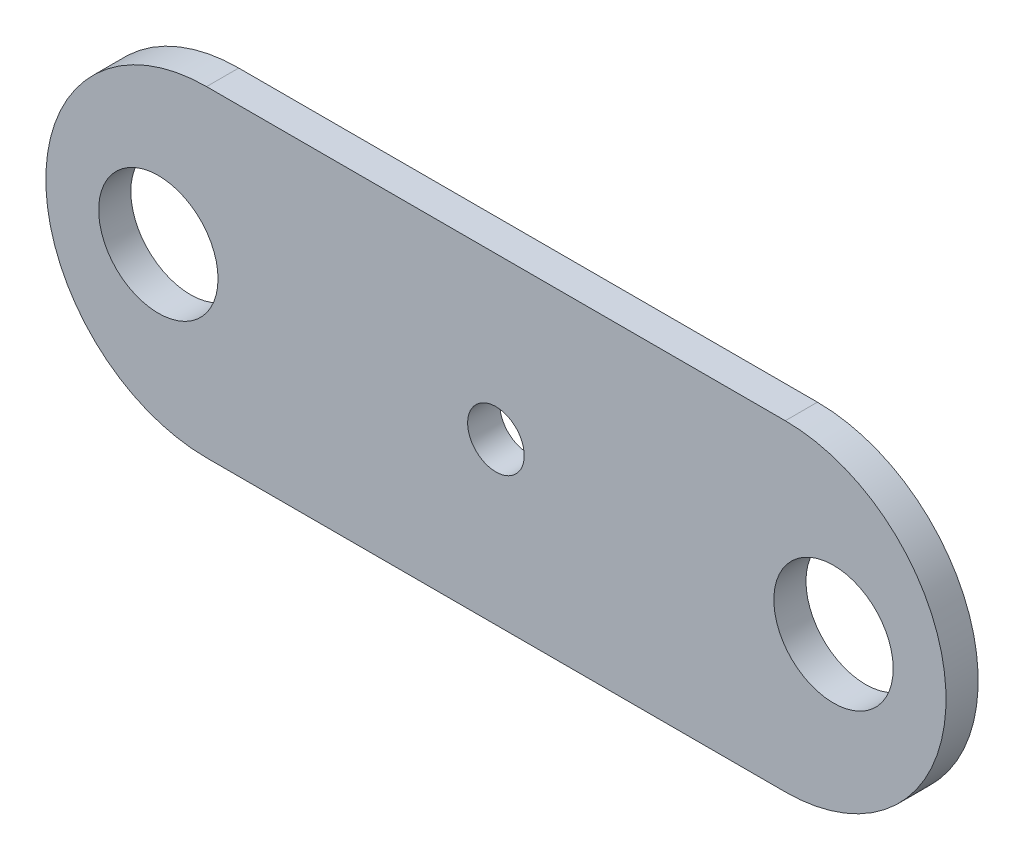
ISO-10303-21;
HEADER;
FILE_DESCRIPTION(('STEP AP214'),'2;1');
FILE_NAME('part.step','',(''),(''),'','','');
FILE_SCHEMA(('AUTOMOTIVE_DESIGN { 1 0 10303 214 1 1 1 1 }'));
ENDSEC;
DATA;
#1=APPLICATION_CONTEXT('core data for automotive mechanical design processes');
#2=APPLICATION_PROTOCOL_DEFINITION('international standard','automotive_design',2000,#1);
#3=PRODUCT_CONTEXT('',#1,'mechanical');
#4=PRODUCT('Part','Part','',(#3));
#5=PRODUCT_RELATED_PRODUCT_CATEGORY('part','',(#4));
#6=PRODUCT_DEFINITION_FORMATION('','',#4);
#7=PRODUCT_DEFINITION_CONTEXT('part definition',#1,'design');
#8=PRODUCT_DEFINITION('design','',#6,#7);
#9=PRODUCT_DEFINITION_SHAPE('','',#8);
#10=(LENGTH_UNIT() NAMED_UNIT(*) SI_UNIT(.MILLI.,.METRE.));
#11=(NAMED_UNIT(*) PLANE_ANGLE_UNIT() SI_UNIT($,.RADIAN.));
#12=(NAMED_UNIT(*) SI_UNIT($,.STERADIAN.) SOLID_ANGLE_UNIT());
#13=UNCERTAINTY_MEASURE_WITH_UNIT(LENGTH_MEASURE(1.E-05),#10,'distance_accuracy_value','');
#14=(GEOMETRIC_REPRESENTATION_CONTEXT(3) GLOBAL_UNCERTAINTY_ASSIGNED_CONTEXT((#13)) GLOBAL_UNIT_ASSIGNED_CONTEXT((#10,
#11,#12)) REPRESENTATION_CONTEXT('',''));
#15=CARTESIAN_POINT('',(0.,0.,0.));
#16=DIRECTION('',(0.,0.,1.));
#17=DIRECTION('',(1.,0.,0.));
#18=AXIS2_PLACEMENT_3D('',#15,#16,#17);
#19=CARTESIAN_POINT('',(-7.14375,0.,0.396875));
#20=DIRECTION('',(0.,0.,-1.));
#21=DIRECTION('',(-1.,0.,0.));
#22=AXIS2_PLACEMENT_3D('',#19,#20,#21);
#23=CYLINDRICAL_SURFACE('',#22,3.96875);
#24=CARTESIAN_POINT('',(-7.14375,0.,-0.396875));
#25=DIRECTION('',(0.,0.,1.));
#26=DIRECTION('',(-1.,0.,0.));
#27=AXIS2_PLACEMENT_3D('',#24,#25,#26);
#28=CIRCLE('',#27,3.96875);
#29=CARTESIAN_POINT('',(-7.14375,3.96875,-0.396875));
#30=VERTEX_POINT('',#29);
#31=CARTESIAN_POINT('',(-7.14375,-3.96875,-0.396875));
#32=VERTEX_POINT('',#31);
#33=EDGE_CURVE('E77',#30,#32,#28,.T.);
#34=ORIENTED_EDGE('',*,*,#33,.T.);
#35=DIRECTION('',(0.,0.,-1.));
#36=VECTOR('',#35,1.);
#37=CARTESIAN_POINT('',(-7.14375,-3.96875,0.396875));
#38=LINE('',#37,#36);
#39=CARTESIAN_POINT('',(-7.14375,-3.96875,0.396875));
#40=VERTEX_POINT('',#39);
#41=EDGE_CURVE('E11',#40,#32,#38,.T.);
#42=ORIENTED_EDGE('',*,*,#41,.F.);
#43=CARTESIAN_POINT('',(-7.14375,0.,0.396875));
#44=DIRECTION('',(0.,0.,1.));
#45=DIRECTION('',(-1.,0.,0.));
#46=AXIS2_PLACEMENT_3D('',#43,#44,#45);
#47=CIRCLE('',#46,3.96875);
#48=CARTESIAN_POINT('',(-7.14375,3.96875,0.396875));
#49=VERTEX_POINT('',#48);
#50=EDGE_CURVE('E100',#49,#40,#47,.T.);
#51=ORIENTED_EDGE('',*,*,#50,.F.);
#52=DIRECTION('',(0.,0.,-1.));
#53=VECTOR('',#52,1.);
#54=CARTESIAN_POINT('',(-7.14375,3.96875,0.396875));
#55=LINE('',#54,#53);
#56=EDGE_CURVE('E89',#49,#30,#55,.T.);
#57=ORIENTED_EDGE('',*,*,#56,.T.);
#58=EDGE_LOOP('',(#34,#42,#51,#57));
#59=FACE_BOUND('',#58,.T.);
#60=ADVANCED_FACE('F31',(#59),#23,.T.);
#61=CARTESIAN_POINT('',(-7.14375,-3.96875,0.396875));
#62=DIRECTION('',(0.,1.,0.));
#63=DIRECTION('',(0.,0.,1.));
#64=AXIS2_PLACEMENT_3D('',#61,#62,#63);
#65=PLANE('',#64);
#66=DIRECTION('',(1.,0.,0.));
#67=VECTOR('',#66,1.);
#68=CARTESIAN_POINT('',(-7.14375,-3.96875,-0.396875));
#69=LINE('',#68,#67);
#70=CARTESIAN_POINT('',(7.14375,-3.96875,-0.396875));
#71=VERTEX_POINT('',#70);
#72=EDGE_CURVE('E73',#32,#71,#69,.T.);
#73=ORIENTED_EDGE('',*,*,#72,.T.);
#74=DIRECTION('',(0.,0.,-1.));
#75=VECTOR('',#74,1.);
#76=CARTESIAN_POINT('',(7.14375,-3.96875,0.396875));
#77=LINE('',#76,#75);
#78=CARTESIAN_POINT('',(7.14375,-3.96875,0.396875));
#79=VERTEX_POINT('',#78);
#80=EDGE_CURVE('E39',#79,#71,#77,.T.);
#81=ORIENTED_EDGE('',*,*,#80,.F.);
#82=DIRECTION('',(1.,0.,0.));
#83=VECTOR('',#82,1.);
#84=CARTESIAN_POINT('',(-7.14375,-3.96875,0.396875));
#85=LINE('',#84,#83);
#86=EDGE_CURVE('E85',#40,#79,#85,.T.);
#87=ORIENTED_EDGE('',*,*,#86,.F.);
#88=ORIENTED_EDGE('',*,*,#41,.T.);
#89=EDGE_LOOP('',(#73,#81,#87,#88));
#90=FACE_BOUND('',#89,.T.);
#91=ADVANCED_FACE('F84',(#90),#65,.F.);
#92=CARTESIAN_POINT('',(7.14375,0.,0.396875));
#93=DIRECTION('',(0.,0.,-1.));
#94=DIRECTION('',(-1.,0.,0.));
#95=AXIS2_PLACEMENT_3D('',#92,#93,#94);
#96=CYLINDRICAL_SURFACE('',#95,3.96875);
#97=CARTESIAN_POINT('',(7.14375,0.,-0.396875));
#98=DIRECTION('',(0.,0.,1.));
#99=DIRECTION('',(1.,0.,0.));
#100=AXIS2_PLACEMENT_3D('',#97,#98,#99);
#101=CIRCLE('',#100,3.96875);
#102=CARTESIAN_POINT('',(7.14375,3.96875,-0.396875));
#103=VERTEX_POINT('',#102);
#104=EDGE_CURVE('E78',#71,#103,#101,.T.);
#105=ORIENTED_EDGE('',*,*,#104,.T.);
#106=DIRECTION('',(0.,0.,-1.));
#107=VECTOR('',#106,1.);
#108=CARTESIAN_POINT('',(7.14375,3.96875,0.396875));
#109=LINE('',#108,#107);
#110=CARTESIAN_POINT('',(7.14375,3.96875,0.396875));
#111=VERTEX_POINT('',#110);
#112=EDGE_CURVE('E106',#111,#103,#109,.T.);
#113=ORIENTED_EDGE('',*,*,#112,.F.);
#114=CARTESIAN_POINT('',(7.14375,0.,0.396875));
#115=DIRECTION('',(0.,0.,1.));
#116=DIRECTION('',(1.,0.,0.));
#117=AXIS2_PLACEMENT_3D('',#114,#115,#116);
#118=CIRCLE('',#117,3.96875);
#119=EDGE_CURVE('E52',#79,#111,#118,.T.);
#120=ORIENTED_EDGE('',*,*,#119,.F.);
#121=ORIENTED_EDGE('',*,*,#80,.T.);
#122=EDGE_LOOP('',(#105,#113,#120,#121));
#123=FACE_BOUND('',#122,.T.);
#124=ADVANCED_FACE('F110',(#123),#96,.T.);
#125=CARTESIAN_POINT('',(-7.14375,3.96875,0.396875));
#126=DIRECTION('',(0.,-1.,0.));
#127=DIRECTION('',(0.,0.,-1.));
#128=AXIS2_PLACEMENT_3D('',#125,#126,#127);
#129=PLANE('',#128);
#130=DIRECTION('',(-1.,0.,0.));
#131=VECTOR('',#130,1.);
#132=CARTESIAN_POINT('',(-7.14375,3.96875,-0.396875));
#133=LINE('',#132,#131);
#134=EDGE_CURVE('E98',#103,#30,#133,.T.);
#135=ORIENTED_EDGE('',*,*,#134,.T.);
#136=ORIENTED_EDGE('',*,*,#56,.F.);
#137=DIRECTION('',(-1.,0.,0.));
#138=VECTOR('',#137,1.);
#139=CARTESIAN_POINT('',(-7.14375,3.96875,0.396875));
#140=LINE('',#139,#138);
#141=EDGE_CURVE('E47',#111,#49,#140,.T.);
#142=ORIENTED_EDGE('',*,*,#141,.F.);
#143=ORIENTED_EDGE('',*,*,#112,.T.);
#144=EDGE_LOOP('',(#135,#136,#142,#143));
#145=FACE_BOUND('',#144,.T.);
#146=ADVANCED_FACE('F112',(#145),#129,.F.);
#147=CARTESIAN_POINT('',(-7.14375,0.,0.396875));
#148=DIRECTION('',(0.,0.,-1.));
#149=DIRECTION('',(-1.,0.,0.));
#150=AXIS2_PLACEMENT_3D('',#147,#148,#149);
#151=PLANE('',#150);
#152=CARTESIAN_POINT('',(0.,0.,0.396875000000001));
#153=DIRECTION('',(0.,0.,1.));
#154=DIRECTION('',(1.,0.,0.));
#155=AXIS2_PLACEMENT_3D('',#152,#153,#154);
#156=CIRCLE('',#155,0.698499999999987);
#157=CARTESIAN_POINT('',(0.698499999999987,0.,0.396875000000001));
#158=VERTEX_POINT('',#157);
#159=EDGE_CURVE('E186',#158,#158,#156,.T.);
#160=ORIENTED_EDGE('',*,*,#159,.F.);
#161=EDGE_LOOP('',(#160));
#162=FACE_BOUND('',#161,.T.);
#163=CARTESIAN_POINT('',(-8.334375,0.,0.396875));
#164=DIRECTION('',(0.,0.,1.));
#165=DIRECTION('',(1.,0.,0.));
#166=AXIS2_PLACEMENT_3D('',#163,#164,#165);
#167=CIRCLE('',#166,1.4732);
#168=CARTESIAN_POINT('',(-6.861175,0.,0.396875));
#169=VERTEX_POINT('',#168);
#170=EDGE_CURVE('E190',#169,#169,#167,.T.);
#171=ORIENTED_EDGE('',*,*,#170,.F.);
#172=EDGE_LOOP('',(#171));
#173=FACE_BOUND('',#172,.T.);
#174=CARTESIAN_POINT('',(8.334375,0.,0.396875));
#175=DIRECTION('',(0.,0.,1.));
#176=DIRECTION('',(1.,0.,0.));
#177=AXIS2_PLACEMENT_3D('',#174,#175,#176);
#178=CIRCLE('',#177,1.4732);
#179=CARTESIAN_POINT('',(9.807575,0.,0.396875));
#180=VERTEX_POINT('',#179);
#181=EDGE_CURVE('E93',#180,#180,#178,.T.);
#182=ORIENTED_EDGE('',*,*,#181,.F.);
#183=EDGE_LOOP('',(#182));
#184=FACE_BOUND('',#183,.T.);
#185=ORIENTED_EDGE('',*,*,#50,.T.);
#186=ORIENTED_EDGE('',*,*,#86,.T.);
#187=ORIENTED_EDGE('',*,*,#119,.T.);
#188=ORIENTED_EDGE('',*,*,#141,.T.);
#189=EDGE_LOOP('',(#185,#186,#187,#188));
#190=FACE_BOUND('',#189,.T.);
#191=ADVANCED_FACE('F113',(#162,#173,#184,#190),#151,.F.);
#192=CARTESIAN_POINT('',(-7.14375,0.,-0.396875));
#193=DIRECTION('',(0.,0.,-1.));
#194=DIRECTION('',(-1.,0.,0.));
#195=AXIS2_PLACEMENT_3D('',#192,#193,#194);
#196=PLANE('',#195);
#197=CARTESIAN_POINT('',(0.,0.,-0.396875));
#198=DIRECTION('',(0.,0.,-1.));
#199=DIRECTION('',(-1.,0.,0.));
#200=AXIS2_PLACEMENT_3D('',#197,#198,#199);
#201=CIRCLE('',#200,0.698499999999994);
#202=CARTESIAN_POINT('',(-0.698499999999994,0.,-0.396875));
#203=VERTEX_POINT('',#202);
#204=EDGE_CURVE('E189',#203,#203,#201,.T.);
#205=ORIENTED_EDGE('',*,*,#204,.F.);
#206=EDGE_LOOP('',(#205));
#207=FACE_BOUND('',#206,.T.);
#208=CARTESIAN_POINT('',(-8.334375,0.,-0.396875));
#209=DIRECTION('',(0.,0.,-1.));
#210=DIRECTION('',(-1.,0.,0.));
#211=AXIS2_PLACEMENT_3D('',#208,#209,#210);
#212=CIRCLE('',#211,1.4732);
#213=CARTESIAN_POINT('',(-9.807575,0.,-0.396875));
#214=VERTEX_POINT('',#213);
#215=EDGE_CURVE('E34',#214,#214,#212,.T.);
#216=ORIENTED_EDGE('',*,*,#215,.F.);
#217=EDGE_LOOP('',(#216));
#218=FACE_BOUND('',#217,.T.);
#219=CARTESIAN_POINT('',(8.334375,0.,-0.396875));
#220=DIRECTION('',(0.,0.,-1.));
#221=DIRECTION('',(-1.,0.,0.));
#222=AXIS2_PLACEMENT_3D('',#219,#220,#221);
#223=CIRCLE('',#222,1.4732);
#224=CARTESIAN_POINT('',(6.861175,0.,-0.396875));
#225=VERTEX_POINT('',#224);
#226=EDGE_CURVE('E90',#225,#225,#223,.T.);
#227=ORIENTED_EDGE('',*,*,#226,.F.);
#228=EDGE_LOOP('',(#227));
#229=FACE_BOUND('',#228,.T.);
#230=ORIENTED_EDGE('',*,*,#33,.F.);
#231=ORIENTED_EDGE('',*,*,#134,.F.);
#232=ORIENTED_EDGE('',*,*,#104,.F.);
#233=ORIENTED_EDGE('',*,*,#72,.F.);
#234=EDGE_LOOP('',(#230,#231,#232,#233));
#235=FACE_BOUND('',#234,.T.);
#236=ADVANCED_FACE('F74',(#207,#218,#229,#235),#196,.T.);
#237=CARTESIAN_POINT('',(8.334375,0.,0.396875));
#238=DIRECTION('',(0.,0.,1.));
#239=DIRECTION('',(1.,0.,0.));
#240=AXIS2_PLACEMENT_3D('',#237,#238,#239);
#241=CYLINDRICAL_SURFACE('',#240,1.4732);
#242=ORIENTED_EDGE('',*,*,#226,.T.);
#243=EDGE_LOOP('',(#242));
#244=FACE_BOUND('',#243,.T.);
#245=ORIENTED_EDGE('',*,*,#181,.T.);
#246=EDGE_LOOP('',(#245));
#247=FACE_BOUND('',#246,.T.);
#248=ADVANCED_FACE('F121',(#244,#247),#241,.F.);
#249=CARTESIAN_POINT('',(-8.334375,0.,0.396875));
#250=DIRECTION('',(0.,0.,1.));
#251=DIRECTION('',(1.,0.,0.));
#252=AXIS2_PLACEMENT_3D('',#249,#250,#251);
#253=CYLINDRICAL_SURFACE('',#252,1.4732);
#254=ORIENTED_EDGE('',*,*,#215,.T.);
#255=EDGE_LOOP('',(#254));
#256=FACE_BOUND('',#255,.T.);
#257=ORIENTED_EDGE('',*,*,#170,.T.);
#258=EDGE_LOOP('',(#257));
#259=FACE_BOUND('',#258,.T.);
#260=ADVANCED_FACE('F151',(#256,#259),#253,.F.);
#261=CARTESIAN_POINT('',(0.,0.,0.396875));
#262=DIRECTION('',(0.,0.,1.));
#263=DIRECTION('',(1.,0.,0.));
#264=AXIS2_PLACEMENT_3D('',#261,#262,#263);
#265=CYLINDRICAL_SURFACE('',#264,0.698499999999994);
#266=ORIENTED_EDGE('',*,*,#159,.T.);
#267=EDGE_LOOP('',(#266));
#268=FACE_BOUND('',#267,.T.);
#269=ORIENTED_EDGE('',*,*,#204,.T.);
#270=EDGE_LOOP('',(#269));
#271=FACE_BOUND('',#270,.T.);
#272=ADVANCED_FACE('F161',(#268,#271),#265,.F.);
#273=CLOSED_SHELL('',(#60,#91,#124,#146,#191,#236,#248,#260,#272));
#274=MANIFOLD_SOLID_BREP('B2',#273);
#275=ADVANCED_BREP_SHAPE_REPRESENTATION('',(#18,#274),#14);
#276=SHAPE_DEFINITION_REPRESENTATION(#9,#275);
ENDSEC;
END-ISO-10303-21;
